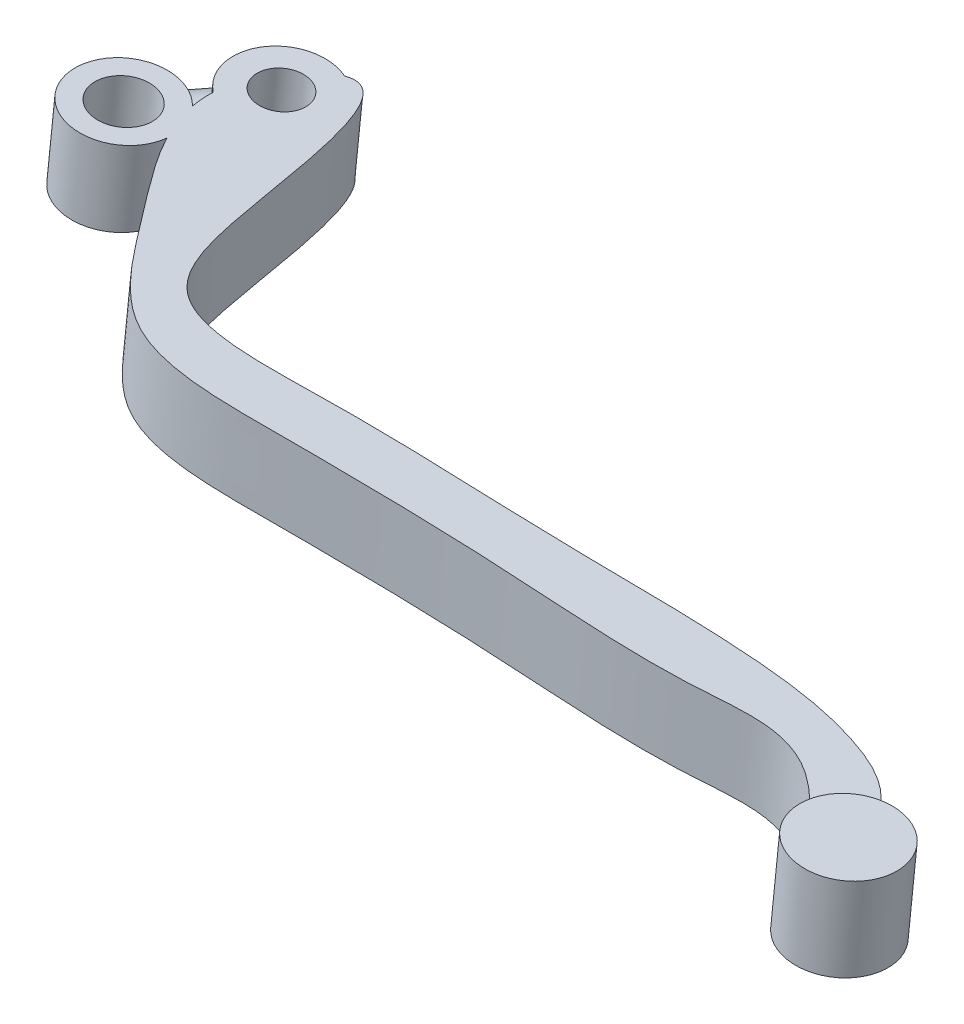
ISO-10303-21;
HEADER;
FILE_DESCRIPTION(('STEP AP214'),'2;1');
FILE_NAME('part.step','',(''),(''),'','','');
FILE_SCHEMA(('AUTOMOTIVE_DESIGN { 1 0 10303 214 1 1 1 1 }'));
ENDSEC;
DATA;
#1=APPLICATION_CONTEXT('core data for automotive mechanical design processes');
#2=APPLICATION_PROTOCOL_DEFINITION('international standard','automotive_design',2000,#1);
#3=PRODUCT_CONTEXT('',#1,'mechanical');
#4=PRODUCT('Part','Part','',(#3));
#5=PRODUCT_RELATED_PRODUCT_CATEGORY('part','',(#4));
#6=PRODUCT_DEFINITION_FORMATION('','',#4);
#7=PRODUCT_DEFINITION_CONTEXT('part definition',#1,'design');
#8=PRODUCT_DEFINITION('design','',#6,#7);
#9=PRODUCT_DEFINITION_SHAPE('','',#8);
#10=(LENGTH_UNIT() NAMED_UNIT(*) SI_UNIT(.MILLI.,.METRE.));
#11=(NAMED_UNIT(*) PLANE_ANGLE_UNIT() SI_UNIT($,.RADIAN.));
#12=(NAMED_UNIT(*) SI_UNIT($,.STERADIAN.) SOLID_ANGLE_UNIT());
#13=UNCERTAINTY_MEASURE_WITH_UNIT(LENGTH_MEASURE(1.E-05),#10,'distance_accuracy_value','');
#14=(GEOMETRIC_REPRESENTATION_CONTEXT(3) GLOBAL_UNCERTAINTY_ASSIGNED_CONTEXT((#13)) GLOBAL_UNIT_ASSIGNED_CONTEXT((#10,
#11,#12)) REPRESENTATION_CONTEXT('',''));
#15=CARTESIAN_POINT('',(0.,0.,0.));
#16=DIRECTION('',(0.,0.,1.));
#17=DIRECTION('',(1.,0.,0.));
#18=AXIS2_PLACEMENT_3D('',#15,#16,#17);
#19=CARTESIAN_POINT('',(251.154082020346,35.3664784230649,9.63590287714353));
#20=CARTESIAN_POINT('',(252.144752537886,35.26541001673,6.79477720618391));
#21=CARTESIAN_POINT('',(259.753498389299,34.4891642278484,-3.37683043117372));
#22=CARTESIAN_POINT('',(262.065558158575,34.2532874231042,19.9311795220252));
#23=CARTESIAN_POINT('',(265.881433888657,33.8639910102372,35.6466948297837));
#24=CARTESIAN_POINT('',(287.423761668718,31.6662383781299,32.1428645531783));
#25=CARTESIAN_POINT('',(305.955974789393,29.7755782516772,31.6126026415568));
#26=CARTESIAN_POINT('',(325.574866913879,27.7740549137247,29.3290289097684));
#27=CARTESIAN_POINT('',(340.025373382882,26.2998113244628,29.8606462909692));
#28=CARTESIAN_POINT('',(349.502064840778,25.332997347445,34.200079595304));
#29=CARTESIAN_POINT('',(350.796580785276,25.200930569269,47.4223544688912));
#30=CARTESIAN_POINT('',(340.315774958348,26.2701844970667,32.7727968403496));
#31=CARTESIAN_POINT('',(326.270514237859,27.7030848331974,36.7307682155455));
#32=CARTESIAN_POINT('',(306.666064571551,29.703134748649,36.9124291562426));
#33=CARTESIAN_POINT('',(287.296502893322,31.6792213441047,38.6130664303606));
#34=CARTESIAN_POINT('',(266.955256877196,33.7544393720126,40.9172491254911));
#35=CARTESIAN_POINT('',(257.023135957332,34.7677163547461,26.5391105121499));
#36=CARTESIAN_POINT('',(248.785632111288,35.6081081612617,16.4283366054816));
#37=CARTESIAN_POINT('',(251.154082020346,35.3664784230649,9.63590287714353));
#38=B_SPLINE_CURVE_WITH_KNOTS('',3,(#19,#20,#21,#22,#23,#24,#25,#26,#27,#28,#29,#30,#31,#32,#33,
#34,#35,#36,#37),.UNSPECIFIED.,.T.,.F.,(4,1,1,1,1,1,1,1,1,1,1,1,1,1,1,1,4),(0.,
0.0330213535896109,0.111967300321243,0.158059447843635,0.223215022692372,0.323820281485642,
0.404313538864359,0.457576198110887,0.499147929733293,0.523288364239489,0.564860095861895,
0.618122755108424,0.69861601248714,0.799221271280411,0.864376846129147,0.921054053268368,1.),.UNSPECIFIED.);
#39=DIRECTION('',(0.101493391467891,0.994836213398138,0.));
#40=VECTOR('',#39,1.);
#41=SURFACE_OF_LINEAR_EXTRUSION('',#38,#40);
#42=CARTESIAN_POINT('',(252.067522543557,44.3200043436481,9.63590287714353));
#43=CARTESIAN_POINT('',(253.058193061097,44.2189359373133,6.79477720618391));
#44=CARTESIAN_POINT('',(260.66693891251,43.4426901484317,-3.37683043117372));
#45=CARTESIAN_POINT('',(262.978998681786,43.2068133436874,19.9311795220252));
#46=CARTESIAN_POINT('',(266.794874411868,42.8175169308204,35.6466948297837));
#47=CARTESIAN_POINT('',(288.337202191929,40.6197642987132,32.1428645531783));
#48=CARTESIAN_POINT('',(306.869415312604,38.7291041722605,31.6126026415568));
#49=CARTESIAN_POINT('',(326.48830743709,36.7275808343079,29.3290289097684));
#50=CARTESIAN_POINT('',(340.938813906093,35.253337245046,29.8606462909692));
#51=CARTESIAN_POINT('',(350.415505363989,34.2865232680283,34.200079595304));
#52=CARTESIAN_POINT('',(351.710021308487,34.1544564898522,47.4223544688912));
#53=CARTESIAN_POINT('',(341.229215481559,35.2237104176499,32.7727968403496));
#54=CARTESIAN_POINT('',(327.18395476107,36.6566107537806,36.7307682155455));
#55=CARTESIAN_POINT('',(307.579505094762,38.6566606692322,36.9124291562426));
#56=CARTESIAN_POINT('',(288.209943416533,40.6327472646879,38.6130664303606));
#57=CARTESIAN_POINT('',(267.868697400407,42.7079652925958,40.9172491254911));
#58=CARTESIAN_POINT('',(257.936576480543,43.7212422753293,26.5391105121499));
#59=CARTESIAN_POINT('',(249.699072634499,44.561634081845,16.4283366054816));
#60=CARTESIAN_POINT('',(252.067522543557,44.3200043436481,9.63590287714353));
#61=B_SPLINE_CURVE_WITH_KNOTS('',3,(#42,#43,#44,#45,#46,#47,#48,#49,#50,#51,#52,#53,#54,#55,#56,
#57,#58,#59,#60),.UNSPECIFIED.,.T.,.F.,(4,1,1,1,1,1,1,1,1,1,1,1,1,1,1,1,4),(0.,
0.0330213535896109,0.111967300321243,0.158059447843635,0.223215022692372,0.323820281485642,
0.404313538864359,0.457576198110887,0.499147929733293,0.523288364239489,0.564860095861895,
0.618122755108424,0.69861601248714,0.799221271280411,0.864376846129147,0.921054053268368,1.),.UNSPECIFIED.);
#62=CARTESIAN_POINT('',(344.957415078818,34.843358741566,39.0058739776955));
#63=VERTEX_POINT('',#62);
#64=CARTESIAN_POINT('',(253.1402761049,44.210561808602,19.6783273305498));
#65=VERTEX_POINT('',#64);
#66=EDGE_CURVE('E285',#63,#65,#61,.T.);
#67=ORIENTED_EDGE('',*,*,#66,.T.);
#68=DIRECTION('',(0.101493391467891,0.994836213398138,0.));
#69=VECTOR('',#68,1.);
#70=CARTESIAN_POINT('',(252.226835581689,35.2570358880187,19.67832733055));
#71=LINE('',#70,#69);
#72=CARTESIAN_POINT('',(252.226835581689,35.2570358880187,19.6783273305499));
#73=VERTEX_POINT('',#72);
#74=EDGE_CURVE('E107',#65,#73,#71,.F.);
#75=ORIENTED_EDGE('',*,*,#74,.T.);
#76=CARTESIAN_POINT('',(344.043974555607,25.8898328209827,39.0058739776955));
#77=VERTEX_POINT('',#76);
#78=EDGE_CURVE('E277',#77,#73,#38,.T.);
#79=ORIENTED_EDGE('',*,*,#78,.F.);
#80=DIRECTION('',(0.101493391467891,0.994836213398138,0.));
#81=VECTOR('',#80,1.);
#82=CARTESIAN_POINT('',(344.043974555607,25.8898328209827,39.0058739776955));
#83=LINE('',#82,#81);
#84=EDGE_CURVE('E308',#77,#63,#83,.T.);
#85=ORIENTED_EDGE('',*,*,#84,.T.);
#86=EDGE_LOOP('',(#67,#75,#79,#85));
#87=FACE_BOUND('',#86,.T.);
#88=ADVANCED_FACE('F75',(#87),#41,.F.);
#89=CARTESIAN_POINT('',(250.702465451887,35.4125524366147,15.2729450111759));
#90=VERTEX_POINT('',#89);
#91=CARTESIAN_POINT('',(250.539004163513,35.4292287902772,12.7612058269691));
#92=VERTEX_POINT('',#91);
#93=EDGE_CURVE('E99',#90,#92,#38,.T.);
#94=ORIENTED_EDGE('',*,*,#93,.F.);
#95=DIRECTION('',(0.101493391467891,0.994836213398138,0.));
#96=VECTOR('',#95,1.);
#97=CARTESIAN_POINT('',(250.702465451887,35.4125524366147,15.2729450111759));
#98=LINE('',#97,#96);
#99=CARTESIAN_POINT('',(250.7711628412,36.0859228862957,15.2729450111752));
#100=VERTEX_POINT('',#99);
#101=EDGE_CURVE('E157',#90,#100,#98,.T.);
#102=ORIENTED_EDGE('',*,*,#101,.T.);
#103=CARTESIAN_POINT('',(251.400202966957,43.8706824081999,12.7612058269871));
#104=CARTESIAN_POINT('',(251.393818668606,43.8777539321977,12.9069344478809));
#105=CARTESIAN_POINT('',(251.390210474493,43.8826766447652,13.0529148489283));
#106=CARTESIAN_POINT('',(251.388369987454,43.8873604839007,13.3454173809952));
#107=CARTESIAN_POINT('',(251.390153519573,43.8871064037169,13.4919398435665));
#108=CARTESIAN_POINT('',(251.398960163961,43.88051749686,13.7848525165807));
#109=CARTESIAN_POINT('',(251.405988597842,43.8741764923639,13.9312424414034));
#110=CARTESIAN_POINT('',(251.425114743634,43.8543891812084,14.2247779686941));
#111=CARTESIAN_POINT('',(251.437265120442,43.8408686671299,14.3719152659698));
#112=CARTESIAN_POINT('',(251.466244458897,43.8057509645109,14.6646233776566));
#113=CARTESIAN_POINT('',(251.483068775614,43.7841617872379,14.8101955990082));
#114=CARTESIAN_POINT('',(251.520890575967,43.7319989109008,15.0990760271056));
#115=CARTESIAN_POINT('',(251.541884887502,43.7014320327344,15.2423858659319));
#116=CARTESIAN_POINT('',(251.586032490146,43.6326117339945,15.517282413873));
#117=CARTESIAN_POINT('',(251.608974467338,43.5949445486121,15.6490491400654));
#118=CARTESIAN_POINT('',(251.657366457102,43.5102598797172,15.909097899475));
#119=CARTESIAN_POINT('',(251.682816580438,43.4632419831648,16.0373797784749));
#120=CARTESIAN_POINT('',(251.735373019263,43.3595276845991,16.2889640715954));
#121=CARTESIAN_POINT('',(251.762471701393,43.3028739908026,16.412285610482));
#122=CARTESIAN_POINT('',(251.817588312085,43.1793410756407,16.6534867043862));
#123=CARTESIAN_POINT('',(251.845606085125,43.1124635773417,16.771367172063));
#124=CARTESIAN_POINT('',(251.897331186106,42.9793250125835,16.9829689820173));
#125=CARTESIAN_POINT('',(251.921040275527,42.9145438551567,17.0776219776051));
#126=CARTESIAN_POINT('',(251.96784982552,42.7774547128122,17.2615181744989));
#127=CARTESIAN_POINT('',(251.990950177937,42.7051454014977,17.3507604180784));
#128=CARTESIAN_POINT('',(252.035920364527,42.5530569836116,17.5231242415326));
#129=CARTESIAN_POINT('',(252.05778914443,42.4732716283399,17.6062405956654));
#130=CARTESIAN_POINT('',(252.099622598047,42.3065491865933,17.7654814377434));
#131=CARTESIAN_POINT('',(252.119587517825,42.219613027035,17.8416068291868));
#132=CARTESIAN_POINT('',(252.157103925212,42.0383605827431,17.9866074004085));
#133=CARTESIAN_POINT('',(252.174637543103,41.9439969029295,18.0554281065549));
#134=CARTESIAN_POINT('',(252.206488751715,41.7490645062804,18.1844038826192));
#135=CARTESIAN_POINT('',(252.220807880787,41.6484987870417,18.244563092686));
#136=CARTESIAN_POINT('',(252.245662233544,41.4419256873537,18.3555117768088));
#137=CARTESIAN_POINT('',(252.256199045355,41.3359206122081,18.4063051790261));
#138=CARTESIAN_POINT('',(252.2730017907,41.1193568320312,18.4979034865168));
#139=CARTESIAN_POINT('',(252.279268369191,41.0087988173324,18.5387098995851));
#140=CARTESIAN_POINT('',(252.2866487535,40.7983278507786,18.6053241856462));
#141=CARTESIAN_POINT('',(252.288311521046,40.6988249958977,18.6323729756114));
#142=CARTESIAN_POINT('',(252.287896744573,40.4979329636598,18.6781449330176));
#143=CARTESIAN_POINT('',(252.285819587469,40.3965439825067,18.6968689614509));
#144=CARTESIAN_POINT('',(252.277824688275,40.1927468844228,18.7257848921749));
#145=CARTESIAN_POINT('',(252.271908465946,40.0903391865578,18.7359801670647));
#146=CARTESIAN_POINT('',(252.256221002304,39.8853238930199,18.7477390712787));
#147=CARTESIAN_POINT('',(252.24644990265,39.7827163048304,18.7493030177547));
#148=CARTESIAN_POINT('',(252.223972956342,39.5855930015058,18.7439842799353));
#149=CARTESIAN_POINT('',(252.211531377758,39.4910301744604,18.7377060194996));
#150=CARTESIAN_POINT('',(252.183515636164,39.3031227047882,18.7177688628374));
#151=CARTESIAN_POINT('',(252.167940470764,39.2097784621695,18.7041076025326));
#152=CARTESIAN_POINT('',(252.133853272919,39.0250391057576,18.6695391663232));
#153=CARTESIAN_POINT('',(252.115342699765,38.9336430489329,18.6486355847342));
#154=CARTESIAN_POINT('',(252.075611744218,38.7533285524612,18.5997655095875));
#155=CARTESIAN_POINT('',(252.054390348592,38.6644110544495,18.5717963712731));
#156=CARTESIAN_POINT('',(252.009502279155,38.4895411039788,18.5090094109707));
#157=CARTESIAN_POINT('',(251.985832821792,38.4035921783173,18.4741837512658));
#158=CARTESIAN_POINT('',(251.936396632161,38.2352497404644,18.3980091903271));
#159=CARTESIAN_POINT('',(251.910629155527,38.1528575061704,18.3566579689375));
#160=CARTESIAN_POINT('',(251.830721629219,37.9117333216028,18.2233324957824));
#161=CARTESIAN_POINT('',(251.773938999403,37.7589107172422,18.12203453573));
#162=CARTESIAN_POINT('',(251.652681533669,37.4625778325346,17.8905457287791));
#163=CARTESIAN_POINT('',(251.587946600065,37.3203195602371,17.7589042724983));
#164=CARTESIAN_POINT('',(251.457819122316,37.0583533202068,17.475151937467));
#165=CARTESIAN_POINT('',(251.392426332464,36.9386541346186,17.3230331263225));
#166=CARTESIAN_POINT('',(251.256460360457,36.7083956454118,16.9822598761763));
#167=CARTESIAN_POINT('',(251.186266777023,36.6008679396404,16.7914160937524));
#168=CARTESIAN_POINT('',(251.053714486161,36.4131370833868,16.3942612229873));
#169=CARTESIAN_POINT('',(250.991359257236,36.3329460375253,16.1879433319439));
#170=CARTESIAN_POINT('',(250.891417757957,36.2135353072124,15.8155289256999));
#171=CARTESIAN_POINT('',(250.851480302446,36.16910069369,15.6516825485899));
#172=CARTESIAN_POINT('',(250.779008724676,36.0929302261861,15.319395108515));
#173=CARTESIAN_POINT('',(250.746478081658,36.0612003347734,15.1509519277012));
#174=CARTESIAN_POINT('',(250.689527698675,36.0088136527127,14.8105917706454));
#175=CARTESIAN_POINT('',(250.665128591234,35.9881849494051,14.6386671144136));
#176=CARTESIAN_POINT('',(250.625041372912,35.9564681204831,14.2930131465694));
#177=CARTESIAN_POINT('',(250.609350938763,35.945377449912,14.1192843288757));
#178=CARTESIAN_POINT('',(250.585437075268,35.9301326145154,13.7475810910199));
#179=CARTESIAN_POINT('',(250.57849601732,35.9271071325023,13.5494773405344));
#180=CARTESIAN_POINT('',(250.576820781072,35.9284619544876,13.2529573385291));
#181=CARTESIAN_POINT('',(250.57770300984,35.9298828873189,13.1545142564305));
#182=CARTESIAN_POINT('',(250.582330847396,35.9344012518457,12.9577506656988));
#183=CARTESIAN_POINT('',(250.58607594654,35.9374983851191,12.8594301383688));
#184=CARTESIAN_POINT('',(250.591245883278,35.9413010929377,12.7612058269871));
#185=B_SPLINE_CURVE_WITH_KNOTS('',3,(#103,#104,#105,#106,#107,#108,#109,#110,#111,#112,#113,
#114,#115,#116,#117,#118,#119,#120,#121,#122,#123,#124,#125,#126,#127,#128,#129,#130,#131,#132,
#133,#134,#135,#136,#137,#138,#139,#140,#141,#142,#143,#144,#145,#146,#147,#148,#149,#150,#151,
#152,#153,#154,#155,#156,#157,#158,#159,#160,#161,#162,#163,#164,#165,#166,#167,#168,#169,#170,
#171,#172,#173,#174,#175,#176,#177,#178,#179,#180,#181,#182,#183,#184),.UNSPECIFIED.,.F.,.F.,(4,
2,2,2,2,2,2,2,2,2,2,2,2,2,2,2,2,2,2,2,2,2,2,2,2,2,2,2,2,2,2,2,2,2,2,2,2,2,2,2,4),(0.,
0.438116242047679,0.877519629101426,1.3173694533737,1.76185668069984,2.20590375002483,
2.64961431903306,3.0661180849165,3.48264025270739,3.89736223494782,4.31201439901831,
4.66304355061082,5.0141346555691,5.36552187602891,5.71686361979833,6.0706644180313,
6.42429553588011,6.77777799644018,7.13120705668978,7.44018308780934,7.749127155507,
8.05794899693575,8.36675949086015,8.65317131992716,8.93967491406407,9.22603652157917,
9.51250547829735,9.79930382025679,10.0862043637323,10.6595403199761,11.2701633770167,
11.8810236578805,12.5685352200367,13.2563508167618,13.7788645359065,14.3016231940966,
14.8256983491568,15.349633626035,15.9437787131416,16.2391049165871,16.5343785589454),.UNSPECIFIED.);
#186=CARTESIAN_POINT('',(250.591245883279,35.9413010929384,12.7612058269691));
#187=VERTEX_POINT('',#186);
#188=EDGE_CURVE('E150',#100,#187,#185,.T.);
#189=ORIENTED_EDGE('',*,*,#188,.T.);
#190=DIRECTION('',(0.101493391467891,0.994836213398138,0.));
#191=VECTOR('',#190,1.);
#192=CARTESIAN_POINT('',(250.539004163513,35.4292287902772,12.7612058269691));
#193=LINE('',#192,#191);
#194=EDGE_CURVE('E263',#187,#92,#193,.F.);
#195=ORIENTED_EDGE('',*,*,#194,.T.);
#196=EDGE_LOOP('',(#94,#102,#189,#195));
#197=FACE_BOUND('',#196,.T.);
#198=ADVANCED_FACE('F158',(#197),#41,.F.);
#199=CARTESIAN_POINT('',(256.741599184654,43.8431541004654,3.24667341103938));
#200=VERTEX_POINT('',#199);
#201=CARTESIAN_POINT('',(348.712592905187,34.460254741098,34.8458584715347));
#202=VERTEX_POINT('',#201);
#203=EDGE_CURVE('E278',#200,#202,#61,.T.);
#204=ORIENTED_EDGE('',*,*,#203,.T.);
#205=DIRECTION('',(0.101493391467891,0.994836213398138,0.));
#206=VECTOR('',#205,1.);
#207=CARTESIAN_POINT('',(347.799152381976,25.5067288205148,34.8458584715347));
#208=LINE('',#207,#206);
#209=CARTESIAN_POINT('',(347.799152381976,25.5067288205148,34.8458584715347));
#210=VERTEX_POINT('',#209);
#211=EDGE_CURVE('E297',#202,#210,#208,.F.);
#212=ORIENTED_EDGE('',*,*,#211,.T.);
#213=CARTESIAN_POINT('',(255.828158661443,34.8896281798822,3.24667341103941));
#214=VERTEX_POINT('',#213);
#215=EDGE_CURVE('E270',#214,#210,#38,.T.);
#216=ORIENTED_EDGE('',*,*,#215,.F.);
#217=DIRECTION('',(0.101493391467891,0.994836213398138,0.));
#218=VECTOR('',#217,1.);
#219=CARTESIAN_POINT('',(255.828158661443,34.8896281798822,3.24667341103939));
#220=LINE('',#219,#218);
#221=EDGE_CURVE('E262',#214,#200,#220,.T.);
#222=ORIENTED_EDGE('',*,*,#221,.T.);
#223=EDGE_LOOP('',(#204,#212,#216,#222));
#224=FACE_BOUND('',#223,.T.);
#225=ADVANCED_FACE('F245',(#224),#41,.F.);
#226=CARTESIAN_POINT('',(251.400202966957,43.870682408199,12.7612058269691));
#227=VERTEX_POINT('',#226);
#228=CARTESIAN_POINT('',(251.547208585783,43.6927079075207,15.272945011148));
#229=VERTEX_POINT('',#228);
#230=EDGE_CURVE('E155',#227,#229,#185,.T.);
#231=ORIENTED_EDGE('',*,*,#230,.T.);
#232=CARTESIAN_POINT('',(251.615905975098,44.366078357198,15.2729450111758));
#233=VERTEX_POINT('',#232);
#234=EDGE_CURVE('E162',#229,#233,#98,.T.);
#235=ORIENTED_EDGE('',*,*,#234,.T.);
#236=CARTESIAN_POINT('',(251.452444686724,44.3827547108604,12.7612058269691));
#237=VERTEX_POINT('',#236);
#238=EDGE_CURVE('E259',#233,#237,#61,.T.);
#239=ORIENTED_EDGE('',*,*,#238,.T.);
#240=EDGE_CURVE('E258',#237,#227,#193,.F.);
#241=ORIENTED_EDGE('',*,*,#240,.T.);
#242=EDGE_LOOP('',(#231,#235,#239,#241));
#243=FACE_BOUND('',#242,.T.);
#244=ADVANCED_FACE('F77',(#243),#41,.F.);
#245=CARTESIAN_POINT('',(349.205070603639,25.3632967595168,37.3542429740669));
#246=DIRECTION('',(-0.101493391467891,-0.994836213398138,0.));
#247=DIRECTION('',(0.994836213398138,-0.101493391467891,0.));
#248=AXIS2_PLACEMENT_3D('',#245,#246,#247);
#249=PLANE('',#248);
#250=CARTESIAN_POINT('',(246.784319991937,35.8122824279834,19.1120011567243));
#251=DIRECTION('',(-0.101493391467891,-0.994836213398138,0.));
#252=DIRECTION('',(0.994836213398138,-0.101493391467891,0.));
#253=AXIS2_PLACEMENT_3D('',#250,#251,#252);
#254=CIRCLE('',#253,3.25000000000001);
#255=CARTESIAN_POINT('',(250.017537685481,35.4824289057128,19.1120011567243));
#256=VERTEX_POINT('',#255);
#257=EDGE_CURVE('E207',#256,#256,#254,.T.);
#258=ORIENTED_EDGE('',*,*,#257,.F.);
#259=EDGE_LOOP('',(#258));
#260=FACE_BOUND('',#259,.T.);
#261=CARTESIAN_POINT('',(253.828715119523,35.093611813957,8.3663038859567));
#262=DIRECTION('',(-0.101493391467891,-0.994836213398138,0.));
#263=DIRECTION('',(0.994836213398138,-0.101493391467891,0.));
#264=AXIS2_PLACEMENT_3D('',#261,#262,#263);
#265=CIRCLE('',#264,2.75000000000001);
#266=CARTESIAN_POINT('',(251.092915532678,35.3727186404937,8.3663038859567));
#267=VERTEX_POINT('',#266);
#268=EDGE_CURVE('E206',#267,#267,#265,.T.);
#269=ORIENTED_EDGE('',*,*,#268,.F.);
#270=EDGE_LOOP('',(#269));
#271=FACE_BOUND('',#270,.T.);
#272=ORIENTED_EDGE('',*,*,#78,.T.);
#273=CARTESIAN_POINT('',(246.784319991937,35.8122824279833,19.1120011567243));
#274=DIRECTION('',(0.101493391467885,0.994836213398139,0.));
#275=DIRECTION('',(-0.994836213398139,0.101493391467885,0.));
#276=AXIS2_PLACEMENT_3D('',#273,#274,#275);
#277=CIRCLE('',#276,5.49999999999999);
#278=EDGE_CURVE('E171',#90,#73,#277,.T.);
#279=ORIENTED_EDGE('',*,*,#278,.F.);
#280=ORIENTED_EDGE('',*,*,#93,.T.);
#281=CARTESIAN_POINT('',(253.828715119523,35.0936118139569,8.3663038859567));
#282=DIRECTION('',(0.101493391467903,0.994836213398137,0.));
#283=DIRECTION('',(-0.994836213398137,0.101493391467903,0.));
#284=AXIS2_PLACEMENT_3D('',#281,#282,#283);
#285=CIRCLE('',#284,5.50000000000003);
#286=EDGE_CURVE('E301',#214,#92,#285,.T.);
#287=ORIENTED_EDGE('',*,*,#286,.F.);
#288=ORIENTED_EDGE('',*,*,#215,.T.);
#289=CARTESIAN_POINT('',(349.4055070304,25.3428481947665,40.1034974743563));
#290=DIRECTION('',(-0.101493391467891,-0.994836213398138,0.));
#291=DIRECTION('',(0.994836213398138,-0.101493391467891,0.));
#292=AXIS2_PLACEMENT_3D('',#289,#290,#291);
#293=CIRCLE('',#292,5.50000000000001);
#294=EDGE_CURVE('E304',#77,#210,#293,.T.);
#295=ORIENTED_EDGE('',*,*,#294,.F.);
#296=EDGE_LOOP('',(#272,#279,#280,#287,#288,#295));
#297=FACE_BOUND('',#296,.T.);
#298=ADVANCED_FACE('F247',(#260,#271,#297),#249,.T.);
#299=CARTESIAN_POINT('',(350.11851112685,34.3168226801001,37.3542429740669));
#300=DIRECTION('',(-0.101493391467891,-0.994836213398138,0.));
#301=DIRECTION('',(0.994836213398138,-0.101493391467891,0.));
#302=AXIS2_PLACEMENT_3D('',#299,#300,#301);
#303=PLANE('',#302);
#304=CARTESIAN_POINT('',(247.697760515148,44.7658083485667,19.1120011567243));
#305=DIRECTION('',(-0.101493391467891,-0.994836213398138,0.));
#306=DIRECTION('',(0.994836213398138,-0.101493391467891,0.));
#307=AXIS2_PLACEMENT_3D('',#304,#305,#306);
#308=CIRCLE('',#307,3.25000000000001);
#309=CARTESIAN_POINT('',(250.930978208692,44.435954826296,19.1120011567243));
#310=VERTEX_POINT('',#309);
#311=EDGE_CURVE('E208',#310,#310,#308,.T.);
#312=ORIENTED_EDGE('',*,*,#311,.T.);
#313=EDGE_LOOP('',(#312));
#314=FACE_BOUND('',#313,.T.);
#315=CARTESIAN_POINT('',(254.742155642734,44.0471377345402,8.3663038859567));
#316=DIRECTION('',(-0.101493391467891,-0.994836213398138,0.));
#317=DIRECTION('',(0.994836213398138,-0.101493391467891,0.));
#318=AXIS2_PLACEMENT_3D('',#315,#316,#317);
#319=CIRCLE('',#318,2.75000000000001);
#320=CARTESIAN_POINT('',(252.006356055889,44.3262445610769,8.3663038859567));
#321=VERTEX_POINT('',#320);
#322=EDGE_CURVE('E204',#321,#321,#319,.T.);
#323=ORIENTED_EDGE('',*,*,#322,.T.);
#324=EDGE_LOOP('',(#323));
#325=FACE_BOUND('',#324,.T.);
#326=ORIENTED_EDGE('',*,*,#238,.F.);
#327=CARTESIAN_POINT('',(247.697760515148,44.7658083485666,19.1120011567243));
#328=DIRECTION('',(0.101493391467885,0.994836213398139,0.));
#329=DIRECTION('',(-0.994836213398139,0.101493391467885,0.));
#330=AXIS2_PLACEMENT_3D('',#327,#328,#329);
#331=CIRCLE('',#330,5.49999999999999);
#332=EDGE_CURVE('E168',#233,#65,#331,.T.);
#333=ORIENTED_EDGE('',*,*,#332,.T.);
#334=ORIENTED_EDGE('',*,*,#66,.F.);
#335=CARTESIAN_POINT('',(350.318947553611,34.2963741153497,40.1034974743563));
#336=DIRECTION('',(-0.101493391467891,-0.994836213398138,0.));
#337=DIRECTION('',(0.994836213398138,-0.101493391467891,0.));
#338=AXIS2_PLACEMENT_3D('',#335,#336,#337);
#339=CIRCLE('',#338,5.50000000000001);
#340=EDGE_CURVE('E276',#63,#202,#339,.T.);
#341=ORIENTED_EDGE('',*,*,#340,.T.);
#342=ORIENTED_EDGE('',*,*,#203,.F.);
#343=CARTESIAN_POINT('',(254.742155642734,44.0471377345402,8.3663038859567));
#344=DIRECTION('',(0.101493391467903,0.994836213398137,0.));
#345=DIRECTION('',(-0.994836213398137,0.101493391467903,0.));
#346=AXIS2_PLACEMENT_3D('',#343,#344,#345);
#347=CIRCLE('',#346,5.50000000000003);
#348=EDGE_CURVE('E267',#200,#237,#347,.T.);
#349=ORIENTED_EDGE('',*,*,#348,.T.);
#350=EDGE_LOOP('',(#326,#333,#334,#341,#342,#349));
#351=FACE_BOUND('',#350,.T.);
#352=ADVANCED_FACE('F252',(#314,#325,#351),#303,.F.);
#353=CARTESIAN_POINT('',(253.828715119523,35.0936118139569,8.3663038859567));
#354=DIRECTION('',(0.101493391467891,0.994836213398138,0.));
#355=DIRECTION('',(-0.994836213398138,0.101493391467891,0.));
#356=AXIS2_PLACEMENT_3D('',#353,#354,#355);
#357=CYLINDRICAL_SURFACE('',#356,5.50000000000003);
#358=CARTESIAN_POINT('',(255.555983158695,39.7820371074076,13.7241189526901));
#359=CARTESIAN_POINT('',(255.554122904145,39.8842134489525,13.7269537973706));
#360=CARTESIAN_POINT('',(255.546800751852,39.9863144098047,13.7310087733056));
#361=CARTESIAN_POINT('',(255.521870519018,40.1891799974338,13.7410663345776));
#362=CARTESIAN_POINT('',(255.504251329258,40.2899430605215,13.7470710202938));
#363=CARTESIAN_POINT('',(255.437081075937,40.5898329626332,13.7670574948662));
#364=CARTESIAN_POINT('',(255.373243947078,40.7857568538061,13.7829801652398));
#365=CARTESIAN_POINT('',(255.246830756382,41.0897506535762,13.8078123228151));
#366=CARTESIAN_POINT('',(255.193691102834,41.2019887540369,13.817010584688));
#367=CARTESIAN_POINT('',(255.077895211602,41.4215709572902,13.8338639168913));
#368=CARTESIAN_POINT('',(255.015241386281,41.5289162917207,13.8415193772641));
#369=CARTESIAN_POINT('',(254.881601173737,41.7384613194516,13.8541838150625));
#370=CARTESIAN_POINT('',(254.810612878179,41.8406598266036,13.8591921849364));
#371=CARTESIAN_POINT('',(254.661311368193,42.0396195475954,13.865570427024));
#372=CARTESIAN_POINT('',(254.582998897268,42.1363813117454,13.8669406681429));
#373=CARTESIAN_POINT('',(254.335838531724,42.4208965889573,13.8641753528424));
#374=CARTESIAN_POINT('',(254.156699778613,42.5999024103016,13.8529294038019));
#375=CARTESIAN_POINT('',(253.777732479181,42.9300485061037,13.8047626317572));
#376=CARTESIAN_POINT('',(253.577937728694,43.0812332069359,13.7678831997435));
#377=CARTESIAN_POINT('',(253.206736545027,43.3220495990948,13.6736761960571));
#378=CARTESIAN_POINT('',(253.037976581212,43.4179453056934,13.6221365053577));
#379=CARTESIAN_POINT('',(252.781596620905,43.542884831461,13.5288422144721));
#380=CARTESIAN_POINT('',(252.695577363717,43.5813870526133,13.4950708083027));
#381=CARTESIAN_POINT('',(252.523092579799,43.6516514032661,13.4221313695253));
#382=CARTESIAN_POINT('',(252.436627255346,43.6834163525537,13.3829656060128));
#383=CARTESIAN_POINT('',(252.26344598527,43.7399626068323,13.2990328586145));
#384=CARTESIAN_POINT('',(252.176731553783,43.7647017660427,13.2542343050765));
#385=CARTESIAN_POINT('',(252.004366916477,43.8065997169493,13.1594315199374));
#386=CARTESIAN_POINT('',(251.918716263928,43.8237618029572,13.1094295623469));
#387=CARTESIAN_POINT('',(251.749215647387,43.8502947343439,13.0045407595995));
#388=CARTESIAN_POINT('',(251.66536569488,43.8596655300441,12.949653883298));
#389=CARTESIAN_POINT('',(251.500205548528,43.870526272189,12.8354677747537));
#390=CARTESIAN_POINT('',(251.418895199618,43.8720167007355,12.7761688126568));
#391=CARTESIAN_POINT('',(251.266466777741,43.8673824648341,12.6591092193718));
#392=CARTESIAN_POINT('',(251.195080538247,43.8619147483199,12.6016704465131));
#393=CARTESIAN_POINT('',(251.055363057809,43.8446079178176,12.4840847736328));
#394=CARTESIAN_POINT('',(250.987032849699,43.8327666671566,12.4239369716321));
#395=CARTESIAN_POINT('',(250.787186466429,43.7879736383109,12.2402299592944));
#396=CARTESIAN_POINT('',(250.660700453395,43.7457486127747,12.1133188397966));
#397=CARTESIAN_POINT('',(250.41716792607,43.6362649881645,11.8486487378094));
#398=CARTESIAN_POINT('',(250.300887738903,43.5678810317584,11.7106629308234));
#399=CARTESIAN_POINT('',(250.085257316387,43.4093720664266,11.4340790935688));
#400=CARTESIAN_POINT('',(249.985909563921,43.3192438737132,11.2954809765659));
#401=CARTESIAN_POINT('',(249.787924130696,43.1029711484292,10.998478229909));
#402=CARTESIAN_POINT('',(249.692233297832,42.9733157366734,10.8406764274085));
#403=CARTESIAN_POINT('',(249.520360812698,42.6903984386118,10.5351424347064));
#404=CARTESIAN_POINT('',(249.444228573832,42.5370782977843,10.387436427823));
#405=CARTESIAN_POINT('',(249.337104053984,42.2771894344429,10.1672648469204));
#406=CARTESIAN_POINT('',(249.300506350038,42.1776946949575,10.0890545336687));
#407=CARTESIAN_POINT('',(249.232454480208,41.9714533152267,9.94016663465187));
#408=CARTESIAN_POINT('',(249.201002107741,41.8647041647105,9.86949167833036));
#409=CARTESIAN_POINT('',(249.142744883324,41.644581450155,9.73794578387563));
#410=CARTESIAN_POINT('',(249.115925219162,41.5312306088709,9.67704364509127));
#411=CARTESIAN_POINT('',(249.06624987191,41.2981372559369,9.56719723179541));
#412=CARTESIAN_POINT('',(249.04339063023,41.1784006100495,9.51824220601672));
#413=CARTESIAN_POINT('',(248.996234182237,40.9050414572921,9.42526843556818));
#414=CARTESIAN_POINT('',(248.972814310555,40.7499564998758,9.38497116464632));
#415=CARTESIAN_POINT('',(248.930691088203,40.4347691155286,9.33091965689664));
#416=CARTESIAN_POINT('',(248.911979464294,40.2746760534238,9.31711857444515));
#417=CARTESIAN_POINT('',(248.879362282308,39.9537864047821,9.31779772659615));
#418=CARTESIAN_POINT('',(248.865464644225,39.7929890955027,9.33232430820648));
#419=CARTESIAN_POINT('',(248.843329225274,39.4755181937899,9.38780300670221));
#420=CARTESIAN_POINT('',(248.835100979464,39.3188519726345,9.42879941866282));
#421=CARTESIAN_POINT('',(248.824051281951,38.9661831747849,9.54861158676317));
#422=CARTESIAN_POINT('',(248.823645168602,38.7727613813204,9.63514957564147));
#423=CARTESIAN_POINT('',(248.837305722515,38.4008691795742,9.83491953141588));
#424=CARTESIAN_POINT('',(248.851396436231,38.2224241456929,9.94819560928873));
#425=CARTESIAN_POINT('',(248.897416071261,37.8760231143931,10.1965613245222));
#426=CARTESIAN_POINT('',(248.929854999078,37.7085269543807,10.3321923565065));
#427=CARTESIAN_POINT('',(249.015836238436,37.3903525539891,10.6161675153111));
#428=CARTESIAN_POINT('',(249.06938871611,37.2396824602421,10.7645177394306));
#429=CARTESIAN_POINT('',(249.174742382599,37.0120793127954,11.0089720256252));
#430=CARTESIAN_POINT('',(249.219096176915,36.9292894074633,11.1029116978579));
#431=CARTESIAN_POINT('',(249.317202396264,36.7712270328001,11.292171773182));
#432=CARTESIAN_POINT('',(249.370950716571,36.6959513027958,11.3874915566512));
#433=CARTESIAN_POINT('',(249.488239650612,36.553722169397,11.5781477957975));
#434=CARTESIAN_POINT('',(249.55176923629,36.4867595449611,11.6734841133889));
#435=CARTESIAN_POINT('',(249.688860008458,36.3619869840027,11.862836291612));
#436=CARTESIAN_POINT('',(249.762416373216,36.304172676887,11.9568527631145));
#437=CARTESIAN_POINT('',(249.953527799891,36.175863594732,12.1821144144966));
#438=CARTESIAN_POINT('',(250.076391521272,36.1106256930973,12.3119611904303));
#439=CARTESIAN_POINT('',(250.34123709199,36.0036483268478,12.5612608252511));
#440=CARTESIAN_POINT('',(250.483201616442,35.9618877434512,12.6807229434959));
#441=CARTESIAN_POINT('',(250.783433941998,35.9036470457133,12.9053304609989));
#442=CARTESIAN_POINT('',(250.941742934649,35.887232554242,13.0104380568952));
#443=CARTESIAN_POINT('',(251.269448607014,35.8804214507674,13.2026828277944));
#444=CARTESIAN_POINT('',(251.43884784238,35.8900308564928,13.2898158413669));
#445=CARTESIAN_POINT('',(251.777151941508,35.9334542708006,13.4418816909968));
#446=CARTESIAN_POINT('',(251.945872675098,35.966422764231,13.5074760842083));
#447=CARTESIAN_POINT('',(252.283722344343,36.0537441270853,13.6206878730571));
#448=CARTESIAN_POINT('',(252.452851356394,36.1081013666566,13.6683015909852));
#449=CARTESIAN_POINT('',(252.805233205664,36.2427786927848,13.7510355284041));
#450=CARTESIAN_POINT('',(252.988096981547,36.3252306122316,13.7843112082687));
#451=CARTESIAN_POINT('',(253.345394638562,36.511027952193,13.8333655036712));
#452=CARTESIAN_POINT('',(253.519820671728,36.6143923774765,13.8491281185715));
#453=CARTESIAN_POINT('',(253.888421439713,36.8614153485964,13.8681286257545));
#454=CARTESIAN_POINT('',(254.080121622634,37.008996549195,13.8684457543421));
#455=CARTESIAN_POINT('',(254.440606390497,37.3295937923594,13.8554581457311));
#456=CARTESIAN_POINT('',(254.609385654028,37.5026157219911,13.8421502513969));
#457=CARTESIAN_POINT('',(254.885343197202,37.836968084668,13.8128192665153));
#458=CARTESIAN_POINT('',(254.99809615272,37.9937723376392,13.7978636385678));
#459=CARTESIAN_POINT('',(255.197560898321,38.3232039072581,13.768885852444));
#460=CARTESIAN_POINT('',(255.284321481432,38.4958007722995,13.7548619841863));
#461=CARTESIAN_POINT('',(255.41244601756,38.823425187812,13.7346512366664));
#462=CARTESIAN_POINT('',(255.459080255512,38.9762897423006,13.7275256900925));
#463=CARTESIAN_POINT('',(255.509446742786,39.2096599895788,13.7213743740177));
#464=CARTESIAN_POINT('',(255.522969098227,39.2880790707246,13.7200795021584));
#465=CARTESIAN_POINT('',(255.543340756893,39.4457741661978,13.719076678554));
#466=CARTESIAN_POINT('',(255.550193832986,39.5250496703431,13.7193678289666));
#467=CARTESIAN_POINT('',(255.55500275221,39.6340237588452,13.7208420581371));
#468=CARTESIAN_POINT('',(255.555843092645,39.6636291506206,13.7213511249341));
#469=CARTESIAN_POINT('',(255.556602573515,39.7228375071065,13.7225790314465));
#470=CARTESIAN_POINT('',(255.556522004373,39.752440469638,13.7232978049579));
#471=CARTESIAN_POINT('',(255.555983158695,39.7820371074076,13.7241189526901));
#472=B_SPLINE_CURVE_WITH_KNOTS('',3,(#358,#359,#360,#361,#362,#363,#364,#365,#366,#367,#368,
#369,#370,#371,#372,#373,#374,#375,#376,#377,#378,#379,#380,#381,#382,#383,#384,#385,#386,#387,
#388,#389,#390,#391,#392,#393,#394,#395,#396,#397,#398,#399,#400,#401,#402,#403,#404,#405,#406,
#407,#408,#409,#410,#411,#412,#413,#414,#415,#416,#417,#418,#419,#420,#421,#422,#423,#424,#425,
#426,#427,#428,#429,#430,#431,#432,#433,#434,#435,#436,#437,#438,#439,#440,#441,#442,#443,#444,
#445,#446,#447,#448,#449,#450,#451,#452,#453,#454,#455,#456,#457,#458,#459,#460,#461,#462,#463,
#464,#465,#466,#467,#468,#469,#470,#471),.UNSPECIFIED.,.T.,.F.,(4,2,2,2,2,2,2,2,2,2,2,2,2,2,2,2,
2,2,2,2,2,2,2,2,2,2,2,2,2,2,2,2,2,2,2,2,2,2,2,2,2,2,2,2,2,2,2,2,2,2,2,2,2,2,2,2,4),(0.,
0.306652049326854,0.61363555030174,1.22997610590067,1.60318398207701,1.97629738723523,
2.34949639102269,2.72265755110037,3.47953525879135,4.23519364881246,4.8349628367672,
5.13497937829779,5.43487010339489,5.73652352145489,6.0380456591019,6.33956971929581,
6.64107533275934,6.91611563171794,7.19124819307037,7.7410855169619,8.31786735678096,
8.89473370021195,9.56891154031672,10.2447762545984,10.6395682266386,11.0344975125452,
11.4281397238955,11.8214263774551,12.305117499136,12.7879526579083,13.271578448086,
13.7560156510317,14.3882449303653,15.0215246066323,15.6733386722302,16.325466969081,
16.723508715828,17.1213769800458,17.5187999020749,17.9160323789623,18.4842849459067,
19.0520255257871,19.6212335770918,20.1905732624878,20.7402931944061,21.2901255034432,
21.8978802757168,22.5061898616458,23.2291583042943,23.9522943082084,24.5315142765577,
25.1096400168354,25.5872465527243,25.8257541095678,26.064126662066,26.1529802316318,
26.2418057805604),.UNSPECIFIED.);
#473=EDGE_CURVE('E91',#227,#187,#472,.T.);
#474=ORIENTED_EDGE('',*,*,#473,.F.);
#475=ORIENTED_EDGE('',*,*,#240,.F.);
#476=ORIENTED_EDGE('',*,*,#348,.F.);
#477=ORIENTED_EDGE('',*,*,#221,.F.);
#478=ORIENTED_EDGE('',*,*,#286,.T.);
#479=ORIENTED_EDGE('',*,*,#194,.F.);
#480=EDGE_LOOP('',(#474,#475,#476,#477,#478,#479));
#481=FACE_BOUND('',#480,.T.);
#482=ADVANCED_FACE('F300',(#481),#357,.T.);
#483=CARTESIAN_POINT('',(349.354760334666,24.8454300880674,40.1034974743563));
#484=DIRECTION('',(0.101493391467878,0.994836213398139,0.));
#485=DIRECTION('',(-0.994836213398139,0.101493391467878,0.));
#486=AXIS2_PLACEMENT_3D('',#483,#484,#485);
#487=PLANE('',#486);
#488=CARTESIAN_POINT('',(349.354760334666,24.8454300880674,40.1034974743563));
#489=DIRECTION('',(0.101493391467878,0.994836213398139,0.));
#490=DIRECTION('',(-0.994836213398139,0.101493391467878,0.));
#491=AXIS2_PLACEMENT_3D('',#488,#489,#490);
#492=CIRCLE('',#491,5.50000000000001);
#493=CARTESIAN_POINT('',(343.883161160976,25.4036437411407,40.1034974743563));
#494=VERTEX_POINT('',#493);
#495=EDGE_CURVE('E181',#494,#494,#492,.T.);
#496=ORIENTED_EDGE('',*,*,#495,.F.);
#497=EDGE_LOOP('',(#496));
#498=FACE_BOUND('',#497,.T.);
#499=ADVANCED_FACE('F188',(#498),#487,.F.);
#500=CARTESIAN_POINT('',(350.369694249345,34.7937922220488,40.1034974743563));
#501=DIRECTION('',(0.101493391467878,0.994836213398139,0.));
#502=DIRECTION('',(-0.994836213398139,0.101493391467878,0.));
#503=AXIS2_PLACEMENT_3D('',#500,#501,#502);
#504=PLANE('',#503);
#505=CARTESIAN_POINT('',(350.369694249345,34.7937922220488,40.1034974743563));
#506=DIRECTION('',(0.101493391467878,0.994836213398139,0.));
#507=DIRECTION('',(-0.994836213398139,0.101493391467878,0.));
#508=AXIS2_PLACEMENT_3D('',#505,#506,#507);
#509=CIRCLE('',#508,5.50000000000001);
#510=CARTESIAN_POINT('',(344.898095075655,35.3520058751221,40.1034974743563));
#511=VERTEX_POINT('',#510);
#512=EDGE_CURVE('E309',#511,#511,#509,.T.);
#513=ORIENTED_EDGE('',*,*,#512,.T.);
#514=EDGE_LOOP('',(#513));
#515=FACE_BOUND('',#514,.T.);
#516=ADVANCED_FACE('F318',(#515),#504,.T.);
#517=CARTESIAN_POINT('',(349.354760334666,24.8454300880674,40.1034974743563));
#518=DIRECTION('',(0.101493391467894,0.994836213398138,0.));
#519=DIRECTION('',(-0.994836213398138,0.101493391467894,0.));
#520=AXIS2_PLACEMENT_3D('',#517,#518,#519);
#521=CYLINDRICAL_SURFACE('',#520,5.50000000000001);
#522=ORIENTED_EDGE('',*,*,#84,.F.);
#523=ORIENTED_EDGE('',*,*,#294,.T.);
#524=ORIENTED_EDGE('',*,*,#211,.F.);
#525=ORIENTED_EDGE('',*,*,#340,.F.);
#526=EDGE_LOOP('',(#522,#523,#524,#525));
#527=FACE_BOUND('',#526,.T.);
#528=ORIENTED_EDGE('',*,*,#512,.F.);
#529=EDGE_LOOP('',(#528));
#530=FACE_BOUND('',#529,.T.);
#531=ORIENTED_EDGE('',*,*,#495,.T.);
#532=EDGE_LOOP('',(#531));
#533=FACE_BOUND('',#532,.T.);
#534=ADVANCED_FACE('F187',(#527,#530,#533),#521,.T.);
#535=CARTESIAN_POINT('',(254.285435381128,39.5703747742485,8.36630388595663));
#536=DIRECTION('',(-0.547394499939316,0.0558452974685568,0.835009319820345));
#537=DIRECTION('',(0.836314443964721,0.,0.548250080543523));
#538=AXIS2_PLACEMENT_3D('',#535,#536,#537);
#539=CYLINDRICAL_SURFACE('',#538,3.99999999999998);
#540=CARTESIAN_POINT('',(252.661008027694,40.0773830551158,18.140186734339));
#541=CARTESIAN_POINT('',(252.669101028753,40.1785439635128,18.1278386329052));
#542=CARTESIAN_POINT('',(252.676116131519,40.2791822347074,18.1100231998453));
#543=CARTESIAN_POINT('',(252.687723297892,40.4783202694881,18.0643456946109));
#544=CARTESIAN_POINT('',(252.692312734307,40.5768176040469,18.0364727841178));
#545=CARTESIAN_POINT('',(252.70200209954,40.8688662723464,17.9392156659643));
#546=CARTESIAN_POINT('',(252.702955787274,41.0581801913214,17.856304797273));
#547=CARTESIAN_POINT('',(252.693586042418,41.3502331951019,17.7025959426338));
#548=CARTESIAN_POINT('',(252.687562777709,41.4576644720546,17.6399216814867));
#549=CARTESIAN_POINT('',(252.669992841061,41.6672256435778,17.5069386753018));
#550=CARTESIAN_POINT('',(252.65844756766,41.7693568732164,17.4366318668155));
#551=CARTESIAN_POINT('',(252.629284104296,41.9682431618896,17.289924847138));
#552=CARTESIAN_POINT('',(252.611664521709,42.0649969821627,17.2135232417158));
#553=CARTESIAN_POINT('',(252.569831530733,42.2529927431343,17.0559663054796));
#554=CARTESIAN_POINT('',(252.545618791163,42.3442352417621,16.9748114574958));
#555=CARTESIAN_POINT('',(252.461444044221,42.6121226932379,16.7234237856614));
#556=CARTESIAN_POINT('',(252.39032344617,42.7801084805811,16.5474042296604));
#557=CARTESIAN_POINT('',(252.21461688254,43.089517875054,16.1891784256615));
#558=CARTESIAN_POINT('',(252.110085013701,43.2309838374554,16.0069826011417));
#559=CARTESIAN_POINT('',(251.88994087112,43.4563893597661,15.6823493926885));
#560=CARTESIAN_POINT('',(251.781063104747,43.5461758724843,15.5394638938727));
#561=CARTESIAN_POINT('',(251.600679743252,43.6633622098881,15.3302424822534));
#562=CARTESIAN_POINT('',(251.537691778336,43.6995147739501,15.2613385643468));
#563=CARTESIAN_POINT('',(251.406191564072,43.7655978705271,15.1258802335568));
#564=CARTESIAN_POINT('',(251.337681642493,43.7955310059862,15.0593248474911));
#565=CARTESIAN_POINT('',(251.195013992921,43.8489642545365,14.928845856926));
#566=CARTESIAN_POINT('',(251.120825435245,43.8724255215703,14.8649400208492));
#567=CARTESIAN_POINT('',(250.967652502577,43.9123655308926,14.7408617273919));
#568=CARTESIAN_POINT('',(250.888670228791,43.9288473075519,14.6806876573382));
#569=CARTESIAN_POINT('',(250.726485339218,43.9546338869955,14.5646392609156));
#570=CARTESIAN_POINT('',(250.643282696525,43.9639386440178,14.5087649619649));
#571=CARTESIAN_POINT('',(250.4733797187,43.9752832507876,14.4018136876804));
#572=CARTESIAN_POINT('',(250.386679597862,43.977323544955,14.3507364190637));
#573=CARTESIAN_POINT('',(250.218304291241,43.9743162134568,14.2580026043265));
#574=CARTESIAN_POINT('',(250.136856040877,43.9698750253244,14.2159126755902));
#575=CARTESIAN_POINT('',(249.97231853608,43.9551003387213,14.1361880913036));
#576=CARTESIAN_POINT('',(249.889228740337,43.9447648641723,14.0985549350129));
#577=CARTESIAN_POINT('',(249.638470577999,43.9051658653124,13.9925100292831));
#578=CARTESIAN_POINT('',(249.469186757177,43.8673070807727,13.9308837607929));
#579=CARTESIAN_POINT('',(249.122954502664,43.7683009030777,13.8228744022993));
#580=CARTESIAN_POINT('',(248.946036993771,43.7061031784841,13.7773862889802));
#581=CARTESIAN_POINT('',(248.597097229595,43.5611944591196,13.704155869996));
#582=CARTESIAN_POINT('',(248.425075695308,43.4784804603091,13.6764161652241));
#583=CARTESIAN_POINT('',(248.061008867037,43.2791513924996,13.6327581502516));
#584=CARTESIAN_POINT('',(247.870480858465,43.1591712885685,13.6196233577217));
#585=CARTESIAN_POINT('',(247.505004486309,42.8960054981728,13.6094175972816));
#586=CARTESIAN_POINT('',(247.330096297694,42.7527624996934,13.6123869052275));
#587=CARTESIAN_POINT('',(247.070008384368,42.5084789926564,13.6255495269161));
#588=CARTESIAN_POINT('',(246.977763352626,42.4146614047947,13.6322250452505));
#589=CARTESIAN_POINT('',(246.801777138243,42.2194315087,13.6479829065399));
#590=CARTESIAN_POINT('',(246.718038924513,42.1180165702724,13.6570660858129));
#591=CARTESIAN_POINT('',(246.56098226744,41.9079733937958,13.6762313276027));
#592=CARTESIAN_POINT('',(246.487630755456,41.7993697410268,13.6863100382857));
#593=CARTESIAN_POINT('',(246.353056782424,41.5749377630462,13.7059701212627));
#594=CARTESIAN_POINT('',(246.291823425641,41.459116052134,13.7155519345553));
#595=CARTESIAN_POINT('',(246.171221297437,41.1932498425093,13.7346140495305));
#596=CARTESIAN_POINT('',(246.115516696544,41.0414585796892,13.7435647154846));
#597=CARTESIAN_POINT('',(246.029955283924,40.7307027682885,13.7557749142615));
#598=CARTESIAN_POINT('',(246.000052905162,40.5717513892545,13.7590444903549));
#599=CARTESIAN_POINT('',(245.967984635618,40.2508057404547,13.7588863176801));
#600=CARTESIAN_POINT('',(245.965864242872,40.0888069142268,13.7554475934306));
#601=CARTESIAN_POINT('',(245.988300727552,39.766788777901,13.7429351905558));
#602=CARTESIAN_POINT('',(246.012902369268,39.606773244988,13.7338520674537));
#603=CARTESIAN_POINT('',(246.096440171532,39.2444546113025,13.7093780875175));
#604=CARTESIAN_POINT('',(246.163561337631,39.0441436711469,13.6929082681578));
#605=CARTESIAN_POINT('',(246.328919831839,38.6567752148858,13.6612743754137));
#606=CARTESIAN_POINT('',(246.427208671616,38.4697402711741,13.6461125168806));
#607=CARTESIAN_POINT('',(246.651516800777,38.1051502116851,13.6225124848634));
#608=CARTESIAN_POINT('',(246.778263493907,37.9280327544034,13.6142840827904));
#609=CARTESIAN_POINT('',(247.05286341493,37.5906154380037,13.6105355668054));
#610=CARTESIAN_POINT('',(247.200726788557,37.4303237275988,13.6150215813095));
#611=CARTESIAN_POINT('',(247.452498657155,37.1877829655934,13.6361258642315));
#612=CARTESIAN_POINT('',(247.551086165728,37.0994601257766,13.6473360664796));
#613=CARTESIAN_POINT('',(247.753749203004,36.9307308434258,13.6771025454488));
#614=CARTESIAN_POINT('',(247.85782232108,36.8503209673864,13.6956556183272));
#615=CARTESIAN_POINT('',(248.070416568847,36.6983687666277,13.7409307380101));
#616=CARTESIAN_POINT('',(248.178932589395,36.6268166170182,13.7676436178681));
#617=CARTESIAN_POINT('',(248.399336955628,36.4935443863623,13.8299071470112));
#618=CARTESIAN_POINT('',(248.511223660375,36.4318196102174,13.8654535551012));
#619=CARTESIAN_POINT('',(248.785885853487,36.2949866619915,13.9632647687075));
#620=CARTESIAN_POINT('',(248.949831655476,36.2255575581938,14.0304439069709));
#621=CARTESIAN_POINT('',(249.277319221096,36.1121894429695,14.184187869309));
#622=CARTESIAN_POINT('',(249.440861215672,36.0682275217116,14.2707351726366));
#623=CARTESIAN_POINT('',(249.762936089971,36.0077584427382,14.4620235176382));
#624=CARTESIAN_POINT('',(249.921454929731,35.9913225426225,14.5668110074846));
#625=CARTESIAN_POINT('',(250.228098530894,35.9866601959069,14.7911843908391));
#626=CARTESIAN_POINT('',(250.376220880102,35.9984402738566,14.9107737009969));
#627=CARTESIAN_POINT('',(250.653452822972,36.0480942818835,15.1560005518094));
#628=CARTESIAN_POINT('',(250.783041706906,36.0850550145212,15.2812876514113));
#629=CARTESIAN_POINT('',(251.02725662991,36.1819290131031,15.537332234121));
#630=CARTESIAN_POINT('',(251.141879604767,36.2418469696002,15.6680908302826));
#631=CARTESIAN_POINT('',(251.366951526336,36.3895124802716,15.9450265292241));
#632=CARTESIAN_POINT('',(251.475688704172,36.4795268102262,16.0913767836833));
#633=CARTESIAN_POINT('',(251.675067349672,36.6814350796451,16.3813247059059));
#634=CARTESIAN_POINT('',(251.765692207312,36.7933489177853,16.5249197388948));
#635=CARTESIAN_POINT('',(251.945869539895,37.0595948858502,16.8313460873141));
#636=CARTESIAN_POINT('',(252.032000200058,37.2179463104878,16.992701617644));
#637=CARTESIAN_POINT('',(252.184181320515,37.559794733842,17.2974656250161));
#638=CARTESIAN_POINT('',(252.250227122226,37.7432975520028,17.4408699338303));
#639=CARTESIAN_POINT('',(252.354437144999,38.0951716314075,17.6735269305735));
#640=CARTESIAN_POINT('',(252.395534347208,38.2592862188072,17.7678767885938));
#641=CARTESIAN_POINT('',(252.469114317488,38.6015605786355,17.9309268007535));
#642=CARTESIAN_POINT('',(252.501613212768,38.7796932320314,17.999675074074));
#643=CARTESIAN_POINT('',(252.554509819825,39.1149924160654,18.0942188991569));
#644=CARTESIAN_POINT('',(252.576029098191,39.2704192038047,18.1254043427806));
#645=CARTESIAN_POINT('',(252.604856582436,39.5059868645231,18.1521091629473));
#646=CARTESIAN_POINT('',(252.613885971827,39.5848643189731,18.1576679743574));
#647=CARTESIAN_POINT('',(252.630773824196,39.7429148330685,18.1619794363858));
#648=CARTESIAN_POINT('',(252.63863294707,39.822087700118,18.1607359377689));
#649=CARTESIAN_POINT('',(252.648570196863,39.9305385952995,18.1543872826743));
#650=CARTESIAN_POINT('',(252.651182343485,39.9599632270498,18.152193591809));
#651=CARTESIAN_POINT('',(252.656229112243,40.0187341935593,18.1468815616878));
#652=CARTESIAN_POINT('',(252.658663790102,40.0480805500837,18.1437635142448));
#653=CARTESIAN_POINT('',(252.661008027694,40.0773830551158,18.140186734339));
#654=B_SPLINE_CURVE_WITH_KNOTS('',3,(#540,#541,#542,#543,#544,#545,#546,#547,#548,#549,#550,
#551,#552,#553,#554,#555,#556,#557,#558,#559,#560,#561,#562,#563,#564,#565,#566,#567,#568,#569,
#570,#571,#572,#573,#574,#575,#576,#577,#578,#579,#580,#581,#582,#583,#584,#585,#586,#587,#588,
#589,#590,#591,#592,#593,#594,#595,#596,#597,#598,#599,#600,#601,#602,#603,#604,#605,#606,#607,
#608,#609,#610,#611,#612,#613,#614,#615,#616,#617,#618,#619,#620,#621,#622,#623,#624,#625,#626,
#627,#628,#629,#630,#631,#632,#633,#634,#635,#636,#637,#638,#639,#640,#641,#642,#643,#644,#645,
#646,#647,#648,#649,#650,#651,#652,#653),.UNSPECIFIED.,.T.,.F.,(4,2,2,2,2,2,2,2,2,2,2,2,2,2,2,2,
2,2,2,2,2,2,2,2,2,2,2,2,2,2,2,2,2,2,2,2,2,2,2,2,2,2,2,2,2,2,2,2,2,2,2,2,2,2,2,2,4),(0.,
0.30665204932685,0.613635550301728,1.22997610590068,1.60318398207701,1.97629738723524,
2.34949639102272,2.72265755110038,3.47953525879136,4.23519364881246,4.8349628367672,
5.13497937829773,5.43487010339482,5.73652352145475,6.03804565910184,6.33956971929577,
6.64107533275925,6.91611563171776,7.19124819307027,7.74108551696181,8.31786735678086,
8.89473370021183,9.56891154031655,10.2447762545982,10.6395682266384,11.0344975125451,
11.4281397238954,11.821426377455,12.3051174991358,12.7879526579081,13.2715784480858,
13.7560156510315,14.3882449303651,15.021524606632,15.6733386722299,16.3254669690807,
16.7235087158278,17.1213769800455,17.5187999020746,17.916032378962,18.4842849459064,
19.0520255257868,19.6212335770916,20.1905732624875,20.7402931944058,21.2901255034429,
21.8978802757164,22.5061898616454,23.2291583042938,23.9522943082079,24.5315142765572,
25.1096400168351,25.5872465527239,25.8257541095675,26.0641266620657,26.1529802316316,
26.2418057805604),.UNSPECIFIED.);
#655=EDGE_CURVE('E12',#229,#100,#654,.T.);
#656=ORIENTED_EDGE('',*,*,#655,.F.);
#657=ORIENTED_EDGE('',*,*,#230,.F.);
#658=ORIENTED_EDGE('',*,*,#473,.T.);
#659=ORIENTED_EDGE('',*,*,#188,.F.);
#660=EDGE_LOOP('',(#656,#657,#658,#659));
#661=FACE_BOUND('',#660,.T.);
#662=ADVANCED_FACE('F151',(#661),#539,.T.);
#663=CARTESIAN_POINT('',(246.784319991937,35.8122824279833,19.1120011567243));
#664=DIRECTION('',(0.101493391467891,0.994836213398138,0.));
#665=DIRECTION('',(-0.994836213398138,0.101493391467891,0.));
#666=AXIS2_PLACEMENT_3D('',#663,#664,#665);
#667=CYLINDRICAL_SURFACE('',#666,5.49999999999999);
#668=CARTESIAN_POINT('',(242.497839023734,40.8069247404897,21.8478713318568));
#669=CARTESIAN_POINT('',(242.502543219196,40.8624426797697,21.8462074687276));
#670=CARTESIAN_POINT('',(242.504879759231,40.9180669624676,21.8404250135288));
#671=CARTESIAN_POINT('',(242.504843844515,41.0278948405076,21.8207571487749));
#672=CARTESIAN_POINT('',(242.502467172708,41.0820971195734,21.8068644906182));
#673=CARTESIAN_POINT('',(242.493315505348,41.1874512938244,21.7713342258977));
#674=CARTESIAN_POINT('',(242.486544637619,41.2386060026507,21.749703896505));
#675=CARTESIAN_POINT('',(242.469135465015,41.3364851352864,21.6992119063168));
#676=CARTESIAN_POINT('',(242.458497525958,41.3832099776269,21.6703509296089));
#677=CARTESIAN_POINT('',(242.43390039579,41.4714240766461,21.605711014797));
#678=CARTESIAN_POINT('',(242.419906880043,41.5128519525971,21.5698613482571));
#679=CARTESIAN_POINT('',(242.389453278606,41.5887055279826,21.4922788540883));
#680=CARTESIAN_POINT('',(242.372993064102,41.6231308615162,21.450545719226));
#681=CARTESIAN_POINT('',(242.338345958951,41.6841297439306,21.3619628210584));
#682=CARTESIAN_POINT('',(242.320150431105,41.7106609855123,21.3150872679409));
#683=CARTESIAN_POINT('',(242.282939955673,41.7547990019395,21.2176076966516));
#684=CARTESIAN_POINT('',(242.263925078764,41.7724065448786,21.1670039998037));
#685=CARTESIAN_POINT('',(242.226075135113,41.7979721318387,21.0640871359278));
#686=CARTESIAN_POINT('',(242.207240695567,41.8060449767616,21.0118022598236));
#687=CARTESIAN_POINT('',(242.170152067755,41.8126683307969,20.906432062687));
#688=CARTESIAN_POINT('',(242.151897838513,41.8112195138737,20.8533467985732));
#689=CARTESIAN_POINT('',(242.116638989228,41.7989229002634,20.7484872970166));
#690=CARTESIAN_POINT('',(242.099623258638,41.7881739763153,20.6967051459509));
#691=CARTESIAN_POINT('',(242.066939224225,41.7577593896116,20.5953842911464));
#692=CARTESIAN_POINT('',(242.051270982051,41.7380933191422,20.5458456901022));
#693=CARTESIAN_POINT('',(242.021331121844,41.6902769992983,20.4501142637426));
#694=CARTESIAN_POINT('',(242.007070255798,41.6620672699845,20.4039478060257));
#695=CARTESIAN_POINT('',(241.980102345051,41.5980427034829,20.316714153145));
#696=CARTESIAN_POINT('',(241.967395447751,41.5622271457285,20.2756474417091));
#697=CARTESIAN_POINT('',(241.943313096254,41.483446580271,20.1993152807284));
#698=CARTESIAN_POINT('',(241.931958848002,41.4403882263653,20.1641394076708));
#699=CARTESIAN_POINT('',(241.910698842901,41.3487050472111,20.1014308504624));
#700=CARTESIAN_POINT('',(241.900793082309,41.3000802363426,20.0738981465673));
#701=CARTESIAN_POINT('',(241.882354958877,41.1986732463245,20.027420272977));
#702=CARTESIAN_POINT('',(241.87382186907,41.1458932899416,20.0084705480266));
#703=CARTESIAN_POINT('',(241.858102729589,41.0376898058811,19.9798197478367));
#704=CARTESIAN_POINT('',(241.850916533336,40.9822665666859,19.9701176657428));
#705=CARTESIAN_POINT('',(241.838054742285,40.8712398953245,19.9603944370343));
#706=CARTESIAN_POINT('',(241.832358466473,40.8156511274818,19.9602328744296));
#707=CARTESIAN_POINT('',(241.822501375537,40.7050994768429,19.96924241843));
#708=CARTESIAN_POINT('',(241.818340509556,40.6501365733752,19.978413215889));
#709=CARTESIAN_POINT('',(241.811822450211,40.5427045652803,20.0056723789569));
#710=CARTESIAN_POINT('',(241.809454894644,40.4902228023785,20.0237085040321));
#711=CARTESIAN_POINT('',(241.806790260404,40.388821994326,20.0680510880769));
#712=CARTESIAN_POINT('',(241.806493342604,40.3399032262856,20.0943581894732));
#713=CARTESIAN_POINT('',(241.808316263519,40.246330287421,20.154752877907));
#714=CARTESIAN_POINT('',(241.810465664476,40.2017355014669,20.1889315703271));
#715=CARTESIAN_POINT('',(241.817562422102,40.1186545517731,20.2638054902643));
#716=CARTESIAN_POINT('',(241.822509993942,40.0801688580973,20.304501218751));
#717=CARTESIAN_POINT('',(241.835546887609,40.0099191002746,20.3916620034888));
#718=CARTESIAN_POINT('',(241.843670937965,39.9782355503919,20.4381868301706));
#719=CARTESIAN_POINT('',(241.863215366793,39.9230230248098,20.5352143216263));
#720=CARTESIAN_POINT('',(241.874635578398,39.8994936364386,20.585716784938));
#721=CARTESIAN_POINT('',(241.900663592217,39.8614008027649,20.6888053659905));
#722=CARTESIAN_POINT('',(241.915248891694,39.8467767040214,20.7413747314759));
#723=CARTESIAN_POINT('',(241.947419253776,39.8266787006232,20.8473366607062));
#724=CARTESIAN_POINT('',(241.965004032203,39.8212039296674,20.9007291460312));
#725=CARTESIAN_POINT('',(242.002446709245,39.8195787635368,21.0060097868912));
#726=CARTESIAN_POINT('',(242.022269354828,39.8232989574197,21.0579085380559));
#727=CARTESIAN_POINT('',(242.063735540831,39.8396788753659,21.1595197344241));
#728=CARTESIAN_POINT('',(242.085379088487,39.8523386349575,21.2092321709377));
#729=CARTESIAN_POINT('',(242.129687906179,39.8862369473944,21.3051757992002));
#730=CARTESIAN_POINT('',(242.152353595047,39.907479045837,21.3514055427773));
#731=CARTESIAN_POINT('',(242.197782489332,39.957955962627,21.4392190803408));
#732=CARTESIAN_POINT('',(242.22054570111,39.9871913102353,21.4808025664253));
#733=CARTESIAN_POINT('',(242.265514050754,40.0533510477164,21.5588980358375));
#734=CARTESIAN_POINT('',(242.287706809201,40.0903779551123,21.5953303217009));
#735=CARTESIAN_POINT('',(242.330185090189,40.1709018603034,21.6615762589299));
#736=CARTESIAN_POINT('',(242.350470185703,40.2144003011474,21.6913884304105));
#737=CARTESIAN_POINT('',(242.388298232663,40.3070371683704,21.7438701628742));
#738=CARTESIAN_POINT('',(242.405821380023,40.3562123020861,21.7664892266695));
#739=CARTESIAN_POINT('',(242.437084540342,40.4585881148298,21.803733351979));
#740=CARTESIAN_POINT('',(242.450828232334,40.5117848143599,21.8183662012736));
#741=CARTESIAN_POINT('',(242.470663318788,40.6054386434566,21.8363666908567));
#742=CARTESIAN_POINT('',(242.4778198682,40.645299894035,21.8417399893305));
#743=CARTESIAN_POINT('',(242.489686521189,40.7257300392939,21.8481010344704));
#744=CARTESIAN_POINT('',(242.49439668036,40.7662989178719,21.8490888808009));
#745=CARTESIAN_POINT('',(242.497839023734,40.8069247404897,21.8478713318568));
#746=B_SPLINE_CURVE_WITH_KNOTS('',3,(#668,#669,#670,#671,#672,#673,#674,#675,#676,#677,#678,
#679,#680,#681,#682,#683,#684,#685,#686,#687,#688,#689,#690,#691,#692,#693,#694,#695,#696,#697,
#698,#699,#700,#701,#702,#703,#704,#705,#706,#707,#708,#709,#710,#711,#712,#713,#714,#715,#716,
#717,#718,#719,#720,#721,#722,#723,#724,#725,#726,#727,#728,#729,#730,#731,#732,#733,#734,#735,
#736,#737,#738,#739,#740,#741,#742,#743,#744,#745),.UNSPECIFIED.,.T.,.F.,(4,2,2,2,2,2,2,2,2,2,2,
2,2,2,2,2,2,2,2,2,2,2,2,2,2,2,2,2,2,2,2,2,2,2,2,2,2,2,4),(0.,0.167075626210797,0.33430080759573,
0.501369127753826,0.66842164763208,0.837261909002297,1.00611099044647,1.17584933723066,
1.3455730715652,1.51323174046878,1.680878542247,1.84676463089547,2.01265830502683,
2.17973454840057,2.34682662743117,2.51626543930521,2.6857038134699,2.85505215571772,
3.02438205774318,3.19121915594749,3.35805072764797,3.52391079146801,3.68978374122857,
3.85768264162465,4.02559445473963,4.19539583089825,4.3651886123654,4.53381161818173,
4.70241865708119,4.8686662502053,5.03491450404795,5.20123150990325,5.367559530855,
5.53623070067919,5.70493953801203,5.87480786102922,6.04451023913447,6.16677232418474,
6.2890316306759),.UNSPECIFIED.);
#747=CARTESIAN_POINT('',(242.497839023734,40.8069247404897,21.8478713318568));
#748=VERTEX_POINT('',#747);
#749=EDGE_CURVE('E210',#748,#748,#746,.T.);
#750=ORIENTED_EDGE('',*,*,#749,.F.);
#751=EDGE_LOOP('',(#750));
#752=FACE_BOUND('',#751,.T.);
#753=ORIENTED_EDGE('',*,*,#74,.F.);
#754=ORIENTED_EDGE('',*,*,#332,.F.);
#755=ORIENTED_EDGE('',*,*,#234,.F.);
#756=ORIENTED_EDGE('',*,*,#655,.T.);
#757=ORIENTED_EDGE('',*,*,#101,.F.);
#758=ORIENTED_EDGE('',*,*,#278,.T.);
#759=EDGE_LOOP('',(#753,#754,#755,#756,#757,#758));
#760=FACE_BOUND('',#759,.T.);
#761=ADVANCED_FACE('F165',(#752,#760),#667,.T.);
#762=CARTESIAN_POINT('',(253.473488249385,31.6116850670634,8.3663038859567));
#763=DIRECTION('',(0.10149339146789,0.994836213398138,0.));
#764=DIRECTION('',(-0.994836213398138,0.10149339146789,0.));
#765=AXIS2_PLACEMENT_3D('',#762,#763,#764);
#766=CYLINDRICAL_SURFACE('',#765,2.75000000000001);
#767=CARTESIAN_POINT('',(251.092915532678,35.3727186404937,8.3663038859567));
#768=CARTESIAN_POINT('',(251.102430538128,35.4659845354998,8.3663038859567));
#769=CARTESIAN_POINT('',(251.111945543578,35.5592504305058,8.3663038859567));
#770=CARTESIAN_POINT('',(251.130975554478,35.745782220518,8.3663038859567));
#771=CARTESIAN_POINT('',(251.140490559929,35.8390481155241,8.3663038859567));
#772=CARTESIAN_POINT('',(251.159520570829,36.0255799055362,8.3663038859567));
#773=CARTESIAN_POINT('',(251.169035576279,36.1188458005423,8.3663038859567));
#774=CARTESIAN_POINT('',(251.188065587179,36.3053775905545,8.3663038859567));
#775=CARTESIAN_POINT('',(251.197580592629,36.3986434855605,8.3663038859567));
#776=CARTESIAN_POINT('',(251.216610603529,36.5851752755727,8.3663038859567));
#777=CARTESIAN_POINT('',(251.22612560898,36.6784411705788,8.3663038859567));
#778=CARTESIAN_POINT('',(251.24515561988,36.8649729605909,8.3663038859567));
#779=CARTESIAN_POINT('',(251.25467062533,36.958238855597,8.3663038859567));
#780=CARTESIAN_POINT('',(251.27370063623,37.1447706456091,8.3663038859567));
#781=CARTESIAN_POINT('',(251.28321564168,37.2380365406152,8.3663038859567));
#782=CARTESIAN_POINT('',(251.30224565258,37.4245683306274,8.3663038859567));
#783=CARTESIAN_POINT('',(251.311760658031,37.5178342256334,8.3663038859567));
#784=CARTESIAN_POINT('',(251.330790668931,37.7043660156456,8.3663038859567));
#785=CARTESIAN_POINT('',(251.340305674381,37.7976319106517,8.3663038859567));
#786=CARTESIAN_POINT('',(251.359335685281,37.9841637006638,8.3663038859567));
#787=CARTESIAN_POINT('',(251.368850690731,38.0774295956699,8.3663038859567));
#788=CARTESIAN_POINT('',(251.387880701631,38.263961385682,8.3663038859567));
#789=CARTESIAN_POINT('',(251.397395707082,38.3572272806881,8.3663038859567));
#790=CARTESIAN_POINT('',(251.416425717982,38.5437590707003,8.3663038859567));
#791=CARTESIAN_POINT('',(251.425940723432,38.6370249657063,8.3663038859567));
#792=CARTESIAN_POINT('',(251.444970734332,38.8235567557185,8.3663038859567));
#793=CARTESIAN_POINT('',(251.454485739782,38.9168226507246,8.3663038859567));
#794=CARTESIAN_POINT('',(251.473515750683,39.1033544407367,8.3663038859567));
#795=CARTESIAN_POINT('',(251.483030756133,39.1966203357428,8.3663038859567));
#796=CARTESIAN_POINT('',(251.502060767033,39.3831521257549,8.3663038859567));
#797=CARTESIAN_POINT('',(251.511575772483,39.476418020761,8.3663038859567));
#798=CARTESIAN_POINT('',(251.530605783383,39.6629498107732,8.3663038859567));
#799=CARTESIAN_POINT('',(251.540120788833,39.7562157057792,8.3663038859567));
#800=CARTESIAN_POINT('',(251.559150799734,39.9427474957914,8.3663038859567));
#801=CARTESIAN_POINT('',(251.568665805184,40.0360133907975,8.3663038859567));
#802=CARTESIAN_POINT('',(251.587695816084,40.2225451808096,8.3663038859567));
#803=CARTESIAN_POINT('',(251.597210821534,40.3158110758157,8.3663038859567));
#804=CARTESIAN_POINT('',(251.616240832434,40.5023428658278,8.3663038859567));
#805=CARTESIAN_POINT('',(251.625755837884,40.5956087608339,8.3663038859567));
#806=CARTESIAN_POINT('',(251.644785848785,40.7821405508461,8.3663038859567));
#807=CARTESIAN_POINT('',(251.654300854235,40.8754064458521,8.3663038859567));
#808=CARTESIAN_POINT('',(251.673330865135,41.0619382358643,8.3663038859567));
#809=CARTESIAN_POINT('',(251.682845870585,41.1552041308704,8.3663038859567));
#810=CARTESIAN_POINT('',(251.701875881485,41.3417359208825,8.3663038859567));
#811=CARTESIAN_POINT('',(251.711390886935,41.4350018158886,8.3663038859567));
#812=CARTESIAN_POINT('',(251.730420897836,41.6215336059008,8.3663038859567));
#813=CARTESIAN_POINT('',(251.739935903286,41.7147995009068,8.3663038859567));
#814=CARTESIAN_POINT('',(251.758965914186,41.901331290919,8.3663038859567));
#815=CARTESIAN_POINT('',(251.768480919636,41.9945971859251,8.3663038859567));
#816=CARTESIAN_POINT('',(251.787510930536,42.1811289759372,8.3663038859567));
#817=CARTESIAN_POINT('',(251.797025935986,42.2743948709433,8.3663038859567));
#818=CARTESIAN_POINT('',(251.816055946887,42.4609266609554,8.3663038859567));
#819=CARTESIAN_POINT('',(251.825570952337,42.5541925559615,8.3663038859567));
#820=CARTESIAN_POINT('',(251.844600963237,42.7407243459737,8.3663038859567));
#821=CARTESIAN_POINT('',(251.854115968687,42.8339902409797,8.3663038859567));
#822=CARTESIAN_POINT('',(251.873145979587,43.0205220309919,8.3663038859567));
#823=CARTESIAN_POINT('',(251.882660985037,43.113787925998,8.3663038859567));
#824=CARTESIAN_POINT('',(251.901690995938,43.3003197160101,8.3663038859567));
#825=CARTESIAN_POINT('',(251.911206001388,43.3935856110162,8.3663038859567));
#826=CARTESIAN_POINT('',(251.930236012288,43.5801174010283,8.3663038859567));
#827=CARTESIAN_POINT('',(251.939751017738,43.6733832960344,8.3663038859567));
#828=CARTESIAN_POINT('',(251.958781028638,43.8599150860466,8.3663038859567));
#829=CARTESIAN_POINT('',(251.968296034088,43.9531809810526,8.3663038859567));
#830=CARTESIAN_POINT('',(251.987326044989,44.1397127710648,8.3663038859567));
#831=CARTESIAN_POINT('',(251.996841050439,44.2329786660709,8.3663038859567));
#832=CARTESIAN_POINT('',(252.006356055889,44.3262445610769,8.3663038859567));
#833=B_SPLINE_CURVE_WITH_KNOTS('',3,(#767,#768,#769,#770,#771,#772,#773,#774,#775,#776,#777,
#778,#779,#780,#781,#782,#783,#784,#785,#786,#787,#788,#789,#790,#791,#792,#793,#794,#795,#796,
#797,#798,#799,#800,#801,#802,#803,#804,#805,#806,#807,#808,#809,#810,#811,#812,#813,#814,#815,
#816,#817,#818,#819,#820,#821,#822,#823,#824,#825,#826,#827,#828,#829,#830,#831,#832),
.UNSPECIFIED.,.F.,.F.,(4,2,2,2,2,2,2,2,2,2,2,2,2,2,2,2,2,2,2,2,2,2,2,2,2,2,2,2,2,2,2,2,4),(0.,
0.281250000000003,0.562500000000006,0.843750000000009,1.12500000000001,1.40625,1.6875,
1.96875000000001,2.25,2.53125,2.8125,3.09375000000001,3.37500000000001,3.65625,3.9375,4.21875,
4.5,4.78125,5.0625,5.34375,5.62500000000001,5.90625,6.1875,6.46875,6.75,7.03125,7.3125,7.59375,
7.875,8.15625,8.4375,8.71875,9.00000000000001),.UNSPECIFIED.);
#834=EDGE_CURVE('BSEAM231',#267,#321,#833,.T.);
#835=ORIENTED_EDGE('',*,*,#268,.T.);
#836=ORIENTED_EDGE('',*,*,#322,.F.);
#837=ORIENTED_EDGE('',*,*,#834,.T.);
#838=ORIENTED_EDGE('',*,*,#834,.F.);
#839=EDGE_LOOP('',(#835,#837,#836,#838));
#840=FACE_BOUND('',#839,.T.);
#841=ADVANCED_FACE('F231',(#840),#766,.F.);
#842=CARTESIAN_POINT('',(246.632079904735,34.3200281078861,19.1120011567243));
#843=DIRECTION('',(0.101493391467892,0.994836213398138,0.));
#844=DIRECTION('',(-0.994836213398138,0.101493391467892,0.));
#845=AXIS2_PLACEMENT_3D('',#842,#843,#844);
#846=CYLINDRICAL_SURFACE('',#845,3.25000000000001);
#847=CARTESIAN_POINT('',(244.671512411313,40.5851661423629,21.0801174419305));
#848=CARTESIAN_POINT('',(244.675908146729,40.6399022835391,21.0785642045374));
#849=CARTESIAN_POINT('',(244.677406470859,40.6947693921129,21.0732190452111));
#850=CARTESIAN_POINT('',(244.6747661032,40.8031263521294,21.0550831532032));
#851=CARTESIAN_POINT('',(244.670625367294,40.8566156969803,21.0422897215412));
#852=CARTESIAN_POINT('',(244.657286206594,40.9605906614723,21.009593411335));
#853=CARTESIAN_POINT('',(244.648097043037,41.0110815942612,20.9897035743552));
#854=CARTESIAN_POINT('',(244.62550315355,41.1078527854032,20.9432168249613));
#855=CARTESIAN_POINT('',(244.612097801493,41.1541324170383,20.9166189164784));
#856=CARTESIAN_POINT('',(244.581582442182,41.2426792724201,20.8562659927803));
#857=CARTESIAN_POINT('',(244.564370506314,41.2847777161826,20.8223147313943));
#858=CARTESIAN_POINT('',(244.527635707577,41.3621369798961,20.7483936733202));
#859=CARTESIAN_POINT('',(244.508112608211,41.3973970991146,20.708423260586));
#860=CARTESIAN_POINT('',(244.467564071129,41.4605461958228,20.6225405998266));
#861=CARTESIAN_POINT('',(244.446519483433,41.4883071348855,20.576542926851));
#862=CARTESIAN_POINT('',(244.40436164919,41.5347295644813,20.4801925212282));
#863=CARTESIAN_POINT('',(244.383248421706,41.5533933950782,20.4298409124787));
#864=CARTESIAN_POINT('',(244.34266929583,41.5804477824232,20.3278999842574));
#865=CARTESIAN_POINT('',(244.323171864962,41.589163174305,20.2764094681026));
#866=CARTESIAN_POINT('',(244.285803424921,41.597106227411,20.1721282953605));
#867=CARTESIAN_POINT('',(244.267932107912,41.5963356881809,20.1193378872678));
#868=CARTESIAN_POINT('',(244.234799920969,41.5855274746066,20.0156557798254));
#869=CARTESIAN_POINT('',(244.219476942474,41.5757677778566,19.9647545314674));
#870=CARTESIAN_POINT('',(244.190988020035,41.5477450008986,19.8647245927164));
#871=CARTESIAN_POINT('',(244.177822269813,41.5294811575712,19.8155960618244));
#872=CARTESIAN_POINT('',(244.153379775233,41.4846777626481,19.7196814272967));
#873=CARTESIAN_POINT('',(244.142139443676,41.4580011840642,19.6729501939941));
#874=CARTESIAN_POINT('',(244.121562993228,41.3972843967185,19.5840730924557));
#875=CARTESIAN_POINT('',(244.112227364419,41.3632422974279,19.5419284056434));
#876=CARTESIAN_POINT('',(244.094723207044,41.2872050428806,19.4618546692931));
#877=CARTESIAN_POINT('',(244.08661655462,41.2449455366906,19.4241626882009));
#878=CARTESIAN_POINT('',(244.071534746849,41.1545818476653,19.3562947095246));
#879=CARTESIAN_POINT('',(244.064559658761,41.1064773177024,19.3261191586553));
#880=CARTESIAN_POINT('',(244.051234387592,41.0055001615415,19.2742994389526));
#881=CARTESIAN_POINT('',(244.044887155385,40.9526070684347,19.2526942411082));
#882=CARTESIAN_POINT('',(244.032499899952,40.8438058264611,19.2191659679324));
#883=CARTESIAN_POINT('',(244.026459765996,40.7878987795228,19.2072393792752));
#884=CARTESIAN_POINT('',(244.014801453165,40.6771947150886,19.1939262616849));
#885=CARTESIAN_POINT('',(244.009176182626,40.6224486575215,19.1921208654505));
#886=CARTESIAN_POINT('',(243.998207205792,40.5134467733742,19.1980110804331));
#887=CARTESIAN_POINT('',(243.992863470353,40.4591908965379,19.2057057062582));
#888=CARTESIAN_POINT('',(243.982920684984,40.353926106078,19.2299602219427));
#889=CARTESIAN_POINT('',(243.978307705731,40.3028717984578,19.2463189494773));
#890=CARTESIAN_POINT('',(243.970176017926,40.2040055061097,19.2871068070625));
#891=CARTESIAN_POINT('',(243.966657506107,40.1561941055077,19.31153738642));
#892=CARTESIAN_POINT('',(243.961212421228,40.0634057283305,19.3685171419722));
#893=CARTESIAN_POINT('',(243.959341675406,40.0185725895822,19.4013057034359));
#894=CARTESIAN_POINT('',(243.958067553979,39.9345231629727,19.4734770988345));
#895=CARTESIAN_POINT('',(243.958664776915,39.8953082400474,19.5128615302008));
#896=CARTESIAN_POINT('',(243.963049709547,39.8220600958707,19.5985981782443));
#897=CARTESIAN_POINT('',(243.966954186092,39.7882710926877,19.64515368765));
#898=CARTESIAN_POINT('',(243.978700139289,39.7285995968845,19.7426362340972));
#899=CARTESIAN_POINT('',(243.986541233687,39.7027163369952,19.7935628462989));
#900=CARTESIAN_POINT('',(244.006389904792,39.6599319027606,19.8974816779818));
#901=CARTESIAN_POINT('',(244.01834005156,39.6429146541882,19.9504369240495));
#902=CARTESIAN_POINT('',(244.046460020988,39.6179175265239,20.057346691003));
#903=CARTESIAN_POINT('',(244.062628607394,39.6099350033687,20.1113009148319));
#904=CARTESIAN_POINT('',(244.098110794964,39.6034161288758,20.2163185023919));
#905=CARTESIAN_POINT('',(244.117272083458,39.6045134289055,20.2674109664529));
#906=CARTESIAN_POINT('',(244.158533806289,39.6152362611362,20.3674643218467));
#907=CARTESIAN_POINT('',(244.180634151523,39.6248615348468,20.41642527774));
#908=CARTESIAN_POINT('',(244.226740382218,39.6522299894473,20.5106485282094));
#909=CARTESIAN_POINT('',(244.250733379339,39.6699216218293,20.5559321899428));
#910=CARTESIAN_POINT('',(244.299712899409,39.7128910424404,20.6421521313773));
#911=CARTESIAN_POINT('',(244.324699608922,39.7381702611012,20.6830875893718));
#912=CARTESIAN_POINT('',(244.375439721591,39.7967161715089,20.7612189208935));
#913=CARTESIAN_POINT('',(244.401188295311,39.8302379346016,20.7982268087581));
#914=CARTESIAN_POINT('',(244.451253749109,39.9039458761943,20.8660789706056));
#915=CARTESIAN_POINT('',(244.475570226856,39.9441339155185,20.8969215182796));
#916=CARTESIAN_POINT('',(244.522114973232,40.031468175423,20.952652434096));
#917=CARTESIAN_POINT('',(244.544266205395,40.0787770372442,20.9773510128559));
#918=CARTESIAN_POINT('',(244.584338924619,40.1782897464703,21.0191188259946));
#919=CARTESIAN_POINT('',(244.602262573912,40.2304910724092,21.0361919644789));
#920=CARTESIAN_POINT('',(244.631130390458,40.3326026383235,21.0609166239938));
#921=CARTESIAN_POINT('',(244.64261422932,40.3821657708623,21.069377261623));
#922=CARTESIAN_POINT('',(244.660748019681,40.482836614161,21.0797038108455));
#923=CARTESIAN_POINT('',(244.667398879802,40.5339440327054,21.0815709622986));
#924=CARTESIAN_POINT('',(244.671512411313,40.5851661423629,21.0801174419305));
#925=B_SPLINE_CURVE_WITH_KNOTS('',3,(#847,#848,#849,#850,#851,#852,#853,#854,#855,#856,#857,
#858,#859,#860,#861,#862,#863,#864,#865,#866,#867,#868,#869,#870,#871,#872,#873,#874,#875,#876,
#877,#878,#879,#880,#881,#882,#883,#884,#885,#886,#887,#888,#889,#890,#891,#892,#893,#894,#895,
#896,#897,#898,#899,#900,#901,#902,#903,#904,#905,#906,#907,#908,#909,#910,#911,#912,#913,#914,
#915,#916,#917,#918,#919,#920,#921,#922,#923,#924),.UNSPECIFIED.,.T.,.F.,(4,2,2,2,2,2,2,2,2,2,2,
2,2,2,2,2,2,2,2,2,2,2,2,2,2,2,2,2,2,2,2,2,2,2,2,2,2,2,4),(0.,0.164611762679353,
0.329283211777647,0.493653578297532,0.658048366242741,0.827537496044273,0.997043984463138,
1.16928397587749,1.34147963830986,1.5078757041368,1.67424020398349,1.83562680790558,
1.99702789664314,2.161206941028,2.32542817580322,2.4962401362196,2.66706224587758,
2.83865244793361,3.0101803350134,3.17455396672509,3.338910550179,3.49960839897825,
3.66033511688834,3.82631835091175,3.99234184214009,4.16448374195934,4.33660892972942,
4.5064201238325,4.67618160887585,4.8391280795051,5.00206961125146,5.16398414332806,
5.32592921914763,5.49371178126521,5.6615412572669,5.83404573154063,6.00646178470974,
6.16053453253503,6.31457830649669),.UNSPECIFIED.);
#926=CARTESIAN_POINT('',(244.671512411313,40.5851661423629,21.0801174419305));
#927=VERTEX_POINT('',#926);
#928=EDGE_CURVE('E81',#927,#927,#925,.T.);
#929=ORIENTED_EDGE('',*,*,#928,.T.);
#930=EDGE_LOOP('',(#929));
#931=FACE_BOUND('',#930,.T.);
#932=ORIENTED_EDGE('',*,*,#257,.T.);
#933=EDGE_LOOP('',(#932));
#934=FACE_BOUND('',#933,.T.);
#935=ORIENTED_EDGE('',*,*,#311,.F.);
#936=EDGE_LOOP('',(#935));
#937=FACE_BOUND('',#936,.T.);
#938=ADVANCED_FACE('F227',(#931,#934,#937),#846,.F.);
#939=CARTESIAN_POINT('',(247.241040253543,40.289045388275,19.1120011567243));
#940=DIRECTION('',(-0.938579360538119,0.0957540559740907,0.331511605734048));
#941=DIRECTION('',(0.333041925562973,0.,0.942912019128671));
#942=AXIS2_PLACEMENT_3D('',#939,#940,#941);
#943=CYLINDRICAL_SURFACE('',#942,1.);
#944=ORIENTED_EDGE('',*,*,#749,.T.);
#945=EDGE_LOOP('',(#944));
#946=FACE_BOUND('',#945,.T.);
#947=ORIENTED_EDGE('',*,*,#928,.F.);
#948=EDGE_LOOP('',(#947));
#949=FACE_BOUND('',#948,.T.);
#950=ADVANCED_FACE('F224',(#946,#949),#943,.F.);
#951=CLOSED_SHELL('',(#88,#198,#225,#244,#298,#352,#482,#499,#516,#534,#662,#761,#841,#938,#950));
#952=MANIFOLD_SOLID_BREP('B2',#951);
#953=ADVANCED_BREP_SHAPE_REPRESENTATION('',(#18,#952),#14);
#954=SHAPE_DEFINITION_REPRESENTATION(#9,#953);
ENDSEC;
END-ISO-10303-21;
